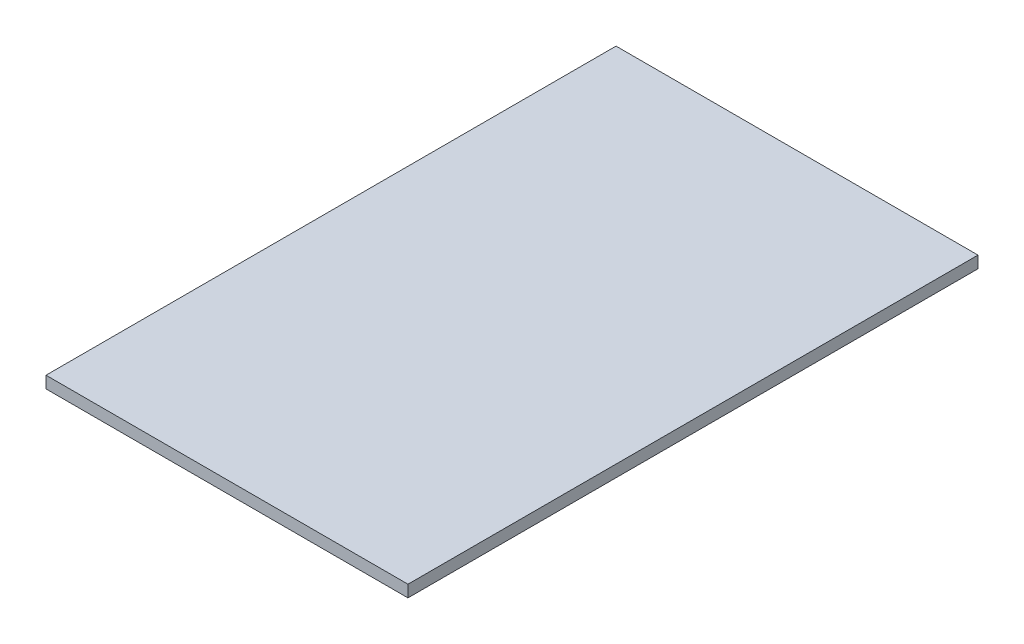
ISO-10303-21;
HEADER;
FILE_DESCRIPTION(('STEP AP214'),'2;1');
FILE_NAME('part.step','',(''),(''),'','','');
FILE_SCHEMA(('AUTOMOTIVE_DESIGN { 1 0 10303 214 1 1 1 1 }'));
ENDSEC;
DATA;
#1=APPLICATION_CONTEXT('core data for automotive mechanical design processes');
#2=APPLICATION_PROTOCOL_DEFINITION('international standard','automotive_design',2000,#1);
#3=PRODUCT_CONTEXT('',#1,'mechanical');
#4=PRODUCT('Part','Part','',(#3));
#5=PRODUCT_RELATED_PRODUCT_CATEGORY('part','',(#4));
#6=PRODUCT_DEFINITION_FORMATION('','',#4);
#7=PRODUCT_DEFINITION_CONTEXT('part definition',#1,'design');
#8=PRODUCT_DEFINITION('design','',#6,#7);
#9=PRODUCT_DEFINITION_SHAPE('','',#8);
#10=(LENGTH_UNIT() NAMED_UNIT(*) SI_UNIT(.MILLI.,.METRE.));
#11=(NAMED_UNIT(*) PLANE_ANGLE_UNIT() SI_UNIT($,.RADIAN.));
#12=(NAMED_UNIT(*) SI_UNIT($,.STERADIAN.) SOLID_ANGLE_UNIT());
#13=UNCERTAINTY_MEASURE_WITH_UNIT(LENGTH_MEASURE(1.E-05),#10,'distance_accuracy_value','');
#14=(GEOMETRIC_REPRESENTATION_CONTEXT(3) GLOBAL_UNCERTAINTY_ASSIGNED_CONTEXT((#13)) GLOBAL_UNIT_ASSIGNED_CONTEXT((#10,
#11,#12)) REPRESENTATION_CONTEXT('',''));
#15=CARTESIAN_POINT('',(0.,0.,0.));
#16=DIRECTION('',(0.,0.,1.));
#17=DIRECTION('',(1.,0.,0.));
#18=AXIS2_PLACEMENT_3D('',#15,#16,#17);
#19=CARTESIAN_POINT('',(-38.1,2.5,60.));
#20=DIRECTION('',(1.,0.,0.));
#21=DIRECTION('',(0.,0.,-1.));
#22=AXIS2_PLACEMENT_3D('',#19,#20,#21);
#23=PLANE('',#22);
#24=DIRECTION('',(0.,0.,1.));
#25=VECTOR('',#24,1.);
#26=CARTESIAN_POINT('',(-38.1,0.,60.));
#27=LINE('',#26,#25);
#28=CARTESIAN_POINT('',(-38.1,0.,-60.));
#29=VERTEX_POINT('',#28);
#30=CARTESIAN_POINT('',(-38.1,0.,60.));
#31=VERTEX_POINT('',#30);
#32=EDGE_CURVE('E98',#29,#31,#27,.T.);
#33=ORIENTED_EDGE('',*,*,#32,.T.);
#34=DIRECTION('',(0.,-1.,0.));
#35=VECTOR('',#34,1.);
#36=CARTESIAN_POINT('',(-38.1,2.5,60.));
#37=LINE('',#36,#35);
#38=CARTESIAN_POINT('',(-38.1,2.5,60.));
#39=VERTEX_POINT('',#38);
#40=EDGE_CURVE('E11',#39,#31,#37,.T.);
#41=ORIENTED_EDGE('',*,*,#40,.F.);
#42=DIRECTION('',(0.,0.,1.));
#43=VECTOR('',#42,1.);
#44=CARTESIAN_POINT('',(-38.1,2.5,60.));
#45=LINE('',#44,#43);
#46=CARTESIAN_POINT('',(-38.1,2.5,-60.));
#47=VERTEX_POINT('',#46);
#48=EDGE_CURVE('E86',#47,#39,#45,.T.);
#49=ORIENTED_EDGE('',*,*,#48,.F.);
#50=DIRECTION('',(0.,-1.,0.));
#51=VECTOR('',#50,1.);
#52=CARTESIAN_POINT('',(-38.1,2.5,-60.));
#53=LINE('',#52,#51);
#54=EDGE_CURVE('E94',#47,#29,#53,.T.);
#55=ORIENTED_EDGE('',*,*,#54,.T.);
#56=EDGE_LOOP('',(#33,#41,#49,#55));
#57=FACE_BOUND('',#56,.T.);
#58=ADVANCED_FACE('F35',(#57),#23,.F.);
#59=CARTESIAN_POINT('',(38.1,2.5,60.));
#60=DIRECTION('',(0.,0.,-1.));
#61=DIRECTION('',(-1.,0.,0.));
#62=AXIS2_PLACEMENT_3D('',#59,#60,#61);
#63=PLANE('',#62);
#64=DIRECTION('',(1.,0.,0.));
#65=VECTOR('',#64,1.);
#66=CARTESIAN_POINT('',(38.1,0.,60.));
#67=LINE('',#66,#65);
#68=CARTESIAN_POINT('',(38.1,0.,60.));
#69=VERTEX_POINT('',#68);
#70=EDGE_CURVE('E90',#31,#69,#67,.T.);
#71=ORIENTED_EDGE('',*,*,#70,.T.);
#72=DIRECTION('',(0.,-1.,0.));
#73=VECTOR('',#72,1.);
#74=CARTESIAN_POINT('',(38.1,2.5,60.));
#75=LINE('',#74,#73);
#76=CARTESIAN_POINT('',(38.1,2.5,60.));
#77=VERTEX_POINT('',#76);
#78=EDGE_CURVE('E43',#77,#69,#75,.T.);
#79=ORIENTED_EDGE('',*,*,#78,.F.);
#80=DIRECTION('',(1.,0.,0.));
#81=VECTOR('',#80,1.);
#82=CARTESIAN_POINT('',(38.1,2.5,60.));
#83=LINE('',#82,#81);
#84=EDGE_CURVE('E81',#39,#77,#83,.T.);
#85=ORIENTED_EDGE('',*,*,#84,.F.);
#86=ORIENTED_EDGE('',*,*,#40,.T.);
#87=EDGE_LOOP('',(#71,#79,#85,#86));
#88=FACE_BOUND('',#87,.T.);
#89=ADVANCED_FACE('F89',(#88),#63,.F.);
#90=CARTESIAN_POINT('',(38.1,2.5,60.));
#91=DIRECTION('',(-1.,0.,0.));
#92=DIRECTION('',(0.,0.,1.));
#93=AXIS2_PLACEMENT_3D('',#90,#91,#92);
#94=PLANE('',#93);
#95=DIRECTION('',(0.,0.,-1.));
#96=VECTOR('',#95,1.);
#97=CARTESIAN_POINT('',(38.1,0.,60.));
#98=LINE('',#97,#96);
#99=CARTESIAN_POINT('',(38.1,0.,-60.));
#100=VERTEX_POINT('',#99);
#101=EDGE_CURVE('E68',#69,#100,#98,.T.);
#102=ORIENTED_EDGE('',*,*,#101,.T.);
#103=DIRECTION('',(0.,-1.,0.));
#104=VECTOR('',#103,1.);
#105=CARTESIAN_POINT('',(38.1,2.5,-60.));
#106=LINE('',#105,#104);
#107=CARTESIAN_POINT('',(38.1,2.5,-60.));
#108=VERTEX_POINT('',#107);
#109=EDGE_CURVE('E91',#108,#100,#106,.T.);
#110=ORIENTED_EDGE('',*,*,#109,.F.);
#111=DIRECTION('',(0.,0.,-1.));
#112=VECTOR('',#111,1.);
#113=CARTESIAN_POINT('',(38.1,2.5,60.));
#114=LINE('',#113,#112);
#115=EDGE_CURVE('E84',#77,#108,#114,.T.);
#116=ORIENTED_EDGE('',*,*,#115,.F.);
#117=ORIENTED_EDGE('',*,*,#78,.T.);
#118=EDGE_LOOP('',(#102,#110,#116,#117));
#119=FACE_BOUND('',#118,.T.);
#120=ADVANCED_FACE('F92',(#119),#94,.F.);
#121=CARTESIAN_POINT('',(38.1,2.5,-60.));
#122=DIRECTION('',(0.,0.,1.));
#123=DIRECTION('',(1.,0.,0.));
#124=AXIS2_PLACEMENT_3D('',#121,#122,#123);
#125=PLANE('',#124);
#126=DIRECTION('',(-1.,0.,0.));
#127=VECTOR('',#126,1.);
#128=CARTESIAN_POINT('',(38.1,0.,-60.));
#129=LINE('',#128,#127);
#130=EDGE_CURVE('E74',#100,#29,#129,.T.);
#131=ORIENTED_EDGE('',*,*,#130,.T.);
#132=ORIENTED_EDGE('',*,*,#54,.F.);
#133=DIRECTION('',(-1.,0.,0.));
#134=VECTOR('',#133,1.);
#135=CARTESIAN_POINT('',(38.1,2.5,-60.));
#136=LINE('',#135,#134);
#137=EDGE_CURVE('E51',#108,#47,#136,.T.);
#138=ORIENTED_EDGE('',*,*,#137,.F.);
#139=ORIENTED_EDGE('',*,*,#109,.T.);
#140=EDGE_LOOP('',(#131,#132,#138,#139));
#141=FACE_BOUND('',#140,.T.);
#142=ADVANCED_FACE('F105',(#141),#125,.F.);
#143=CARTESIAN_POINT('',(0.,2.5,0.));
#144=DIRECTION('',(0.,1.,0.));
#145=DIRECTION('',(0.,0.,1.));
#146=AXIS2_PLACEMENT_3D('',#143,#144,#145);
#147=PLANE('',#146);
#148=ORIENTED_EDGE('',*,*,#48,.T.);
#149=ORIENTED_EDGE('',*,*,#84,.T.);
#150=ORIENTED_EDGE('',*,*,#115,.T.);
#151=ORIENTED_EDGE('',*,*,#137,.T.);
#152=EDGE_LOOP('',(#148,#149,#150,#151));
#153=FACE_BOUND('',#152,.T.);
#154=ADVANCED_FACE('F82',(#153),#147,.T.);
#155=CARTESIAN_POINT('',(0.,0.,0.));
#156=DIRECTION('',(0.,1.,0.));
#157=DIRECTION('',(0.,0.,1.));
#158=AXIS2_PLACEMENT_3D('',#155,#156,#157);
#159=PLANE('',#158);
#160=ORIENTED_EDGE('',*,*,#32,.F.);
#161=ORIENTED_EDGE('',*,*,#130,.F.);
#162=ORIENTED_EDGE('',*,*,#101,.F.);
#163=ORIENTED_EDGE('',*,*,#70,.F.);
#164=EDGE_LOOP('',(#160,#161,#162,#163));
#165=FACE_BOUND('',#164,.T.);
#166=ADVANCED_FACE('F108',(#165),#159,.F.);
#167=CLOSED_SHELL('',(#58,#89,#120,#142,#154,#166));
#168=MANIFOLD_SOLID_BREP('B2',#167);
#169=ADVANCED_BREP_SHAPE_REPRESENTATION('',(#18,#168),#14);
#170=SHAPE_DEFINITION_REPRESENTATION(#9,#169);
ENDSEC;
END-ISO-10303-21;
